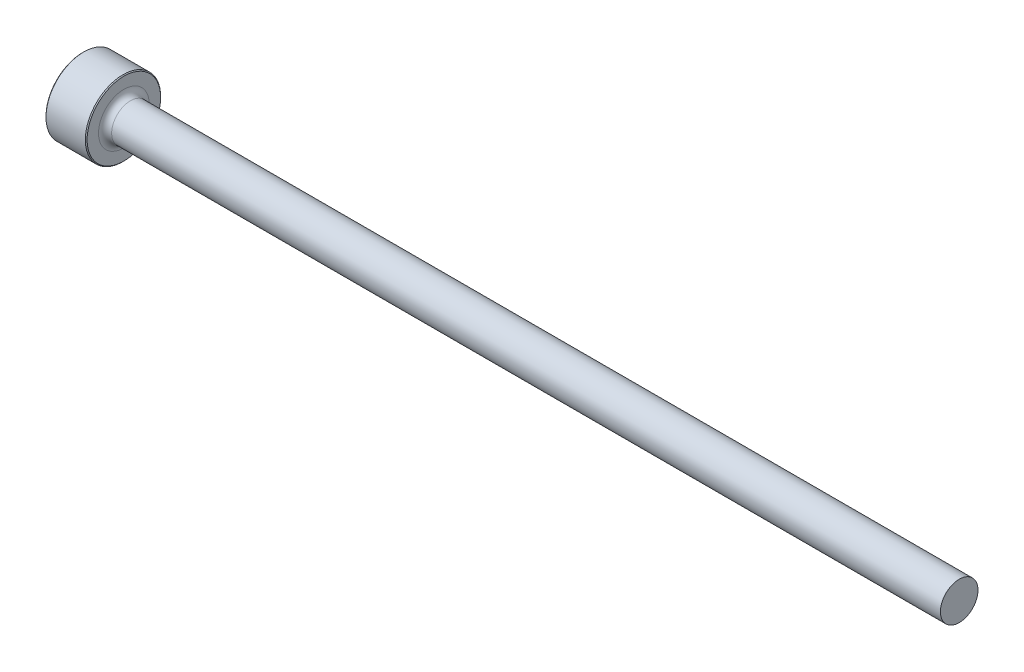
from build123d import *

# Parameters (mm, degrees)
CHAMFER1_SIZE = 0.1016


with BuildPart() as part:
    # Sketch1 → Revolve1 (revolve)
    with BuildSketch(Plane.XY):
        with BuildLine():
            Line((0, 0), (0, 4.365625))
            Line((0, 4.365625), (4.7625, 4.365625))
            Line((4.7625, 4.365625), (4.7625, 2.9410025))
            ThreePointArc((4.7625, 2.9410025), (4.985684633, 2.402187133), (5.5245, 2.1790025))
            Line((5.5245, 2.1790025), (101.6, 2.1790025))
            Line((101.6, 2.1790025), (101.6, 0))
            Line((101.6, 0), (0, 0))
        make_face()
    revolve(axis=Axis((101.6, 0, 0), (-1, 0, 0)))

    # Chamfer1
    chamfer1_edges = [part.edges().sort_by_distance(p)[0] for p in [
        (0, -4.365625, 0),
        (4.7625, -4.365625, 0),
    ]]
    chamfer(chamfer1_edges, length=CHAMFER1_SIZE)


solid = part.part
